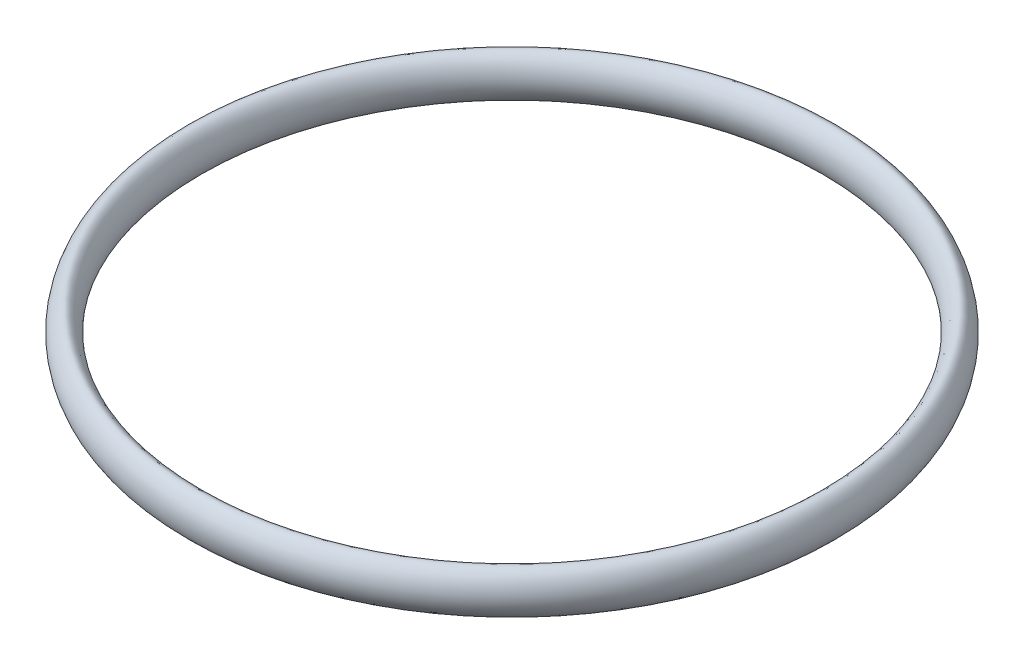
ISO-10303-21;
HEADER;
FILE_DESCRIPTION(('STEP AP214'),'2;1');
FILE_NAME('part.step','',(''),(''),'','','');
FILE_SCHEMA(('AUTOMOTIVE_DESIGN { 1 0 10303 214 1 1 1 1 }'));
ENDSEC;
DATA;
#1=APPLICATION_CONTEXT('core data for automotive mechanical design processes');
#2=APPLICATION_PROTOCOL_DEFINITION('international standard','automotive_design',2000,#1);
#3=PRODUCT_CONTEXT('',#1,'mechanical');
#4=PRODUCT('Part','Part','',(#3));
#5=PRODUCT_RELATED_PRODUCT_CATEGORY('part','',(#4));
#6=PRODUCT_DEFINITION_FORMATION('','',#4);
#7=PRODUCT_DEFINITION_CONTEXT('part definition',#1,'design');
#8=PRODUCT_DEFINITION('design','',#6,#7);
#9=PRODUCT_DEFINITION_SHAPE('','',#8);
#10=(LENGTH_UNIT() NAMED_UNIT(*) SI_UNIT(.MILLI.,.METRE.));
#11=(NAMED_UNIT(*) PLANE_ANGLE_UNIT() SI_UNIT($,.RADIAN.));
#12=(NAMED_UNIT(*) SI_UNIT($,.STERADIAN.) SOLID_ANGLE_UNIT());
#13=UNCERTAINTY_MEASURE_WITH_UNIT(LENGTH_MEASURE(1.E-05),#10,'distance_accuracy_value','');
#14=(GEOMETRIC_REPRESENTATION_CONTEXT(3) GLOBAL_UNCERTAINTY_ASSIGNED_CONTEXT((#13)) GLOBAL_UNIT_ASSIGNED_CONTEXT((#10,
#11,#12)) REPRESENTATION_CONTEXT('',''));
#15=CARTESIAN_POINT('',(0.,0.,0.));
#16=DIRECTION('',(0.,0.,1.));
#17=DIRECTION('',(1.,0.,0.));
#18=AXIS2_PLACEMENT_3D('',#15,#16,#17);
#19=CARTESIAN_POINT('',(-52.815,3.6,0.));
#20=CARTESIAN_POINT('',(-53.9075,3.6,0.));
#21=CARTESIAN_POINT('',(-56.0925,0.,0.));
#22=CARTESIAN_POINT('',(-52.815,-5.4,0.));
#23=CARTESIAN_POINT('',(-49.5375,0.,0.));
#24=CARTESIAN_POINT('',(-51.7225,3.6,0.));
#25=CARTESIAN_POINT('',(-52.815,3.6,0.));
#26=B_SPLINE_CURVE_WITH_KNOTS('',3,(#19,#20,#21,#22,#23,#24,#25),.UNSPECIFIED.,.T.,.F.,(4,1,1,1,
4),(0.,0.25,0.5,0.75,1.),.UNSPECIFIED.);
#27=CARTESIAN_POINT('',(0.,0.,0.));
#28=DIRECTION('',(0.,-1.,0.));
#29=AXIS1_PLACEMENT('',#27,#28);
#30=SURFACE_OF_REVOLUTION('',#26,#29);
#31=ADVANCED_FACE('F28',(),#30,.T.);
#32=CLOSED_SHELL('',(#31));
#33=MANIFOLD_SOLID_BREP('B2',#32);
#34=ADVANCED_BREP_SHAPE_REPRESENTATION('',(#18,#33),#14);
#35=SHAPE_DEFINITION_REPRESENTATION(#9,#34);
ENDSEC;
END-ISO-10303-21;
